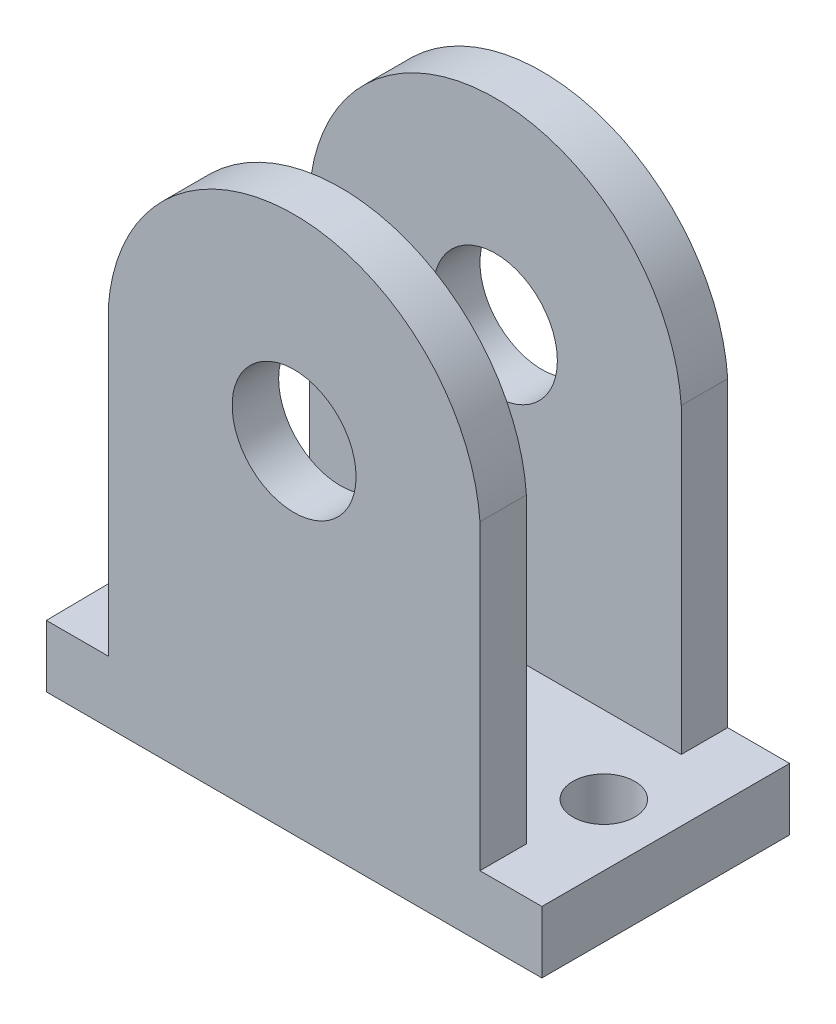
from build123d import *

# Parameters (mm, degrees)
BOSS_EXTRUDE2_DEPTH = 25.4
CUT_EXTRUDE1_DEPTH  = 82.55
BOSS_EXTRUDE4_DEPTH = 6.35
SKETCH7_R           = 6.35
CUT_EXTRUDE3_DEPTH  = 40.894
SKETCH8_R           = 3.175
CUT_EXTRUDE4_DEPTH  = 10.16


with BuildPart() as part:
    # Sketch2 → Boss-Extrude2 (new body)
    with BuildSketch(Plane.XY):
        with BuildLine():
            Line((-31.173932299, 16.527772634), (6.926067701, 16.527772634))
            Line((6.926067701, 16.527772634), (6.926067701, 47.509663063))
            ThreePointArc((6.926067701, 47.509663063), (-12.123932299, 65.271559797), (-31.173932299, 47.509663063))
            Line((-31.173932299, 47.509663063), (-31.173932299, 16.527772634))
        make_face()
    extrude(amount=BOSS_EXTRUDE2_DEPTH)

    # Sketch3 → Cut-Extrude1 (cut)
    with BuildSketch(Plane(origin=(0, 0, 0), x_dir=(1, 0, 0), z_dir=(0, 1, 0))):
        Polygon((-31.173932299, -12.7), (-31.173932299, -4.7625), (6.926067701, -4.7625), (6.926067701, -20.6375), (-31.173932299, -20.6375), align=None)
    extrude(amount=CUT_EXTRUDE1_DEPTH, mode=Mode.SUBTRACT)


with BuildPart() as cut_extrude1_piece_1:
    # of the separate pieces the step leaves, piece 1, a body of its own (cut_extrude1_pieces)
    add(part.part.solids().sort_by_distance((-31.173932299, 16.527772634, 20.6375))[0])



with BuildPart() as cut_extrude1_piece_2:
    # of the separate pieces the step leaves, piece 2, a body of its own (cut_extrude1_pieces)
    add(part.part.solids().sort_by_distance((-31.173932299, 47.509663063, 0))[0])


with BuildPart() as cut_extrude1_piece_1_1:
    add(cut_extrude1_piece_1.part)

    add(cut_extrude1_piece_2.part)  # Boss-Extrude4 merges Cut-Extrude1 piece 2
    # Sketch6 → Boss-Extrude4 (add)
    with BuildSketch(Plane.XZ.offset(-16.527772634)):
        Polygon((-37.523932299, 25.4), (-37.812772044, 0), (-31.173932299, 0), (6.926067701, 0), (13.276067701, 0), (13.276067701, 25.4), align=None)
    extrude(amount=BOSS_EXTRUDE4_DEPTH)

    # Sketch7 → Cut-Extrude3 (cut)
    with BuildSketch(Plane.XY.offset(25.4)):
        with Locations((-12.123932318, 45.143650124)):
            Circle(SKETCH7_R)
    extrude(amount=-CUT_EXTRUDE3_DEPTH, mode=Mode.SUBTRACT)

    # Sketch8 → Cut-Extrude4 (cut)
    with BuildSketch(Plane.XZ.offset(-16.527772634)):
        with Locations(Location((-31.318352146, 12.7, 0), (0, 0, 270))):
            Circle(SKETCH8_R)
        with Locations(Location((6.926067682, 12.7, 0), (0, 0, 270))):
            Circle(SKETCH8_R)
    extrude(amount=CUT_EXTRUDE4_DEPTH, mode=Mode.SUBTRACT)


solid = cut_extrude1_piece_1_1.part
